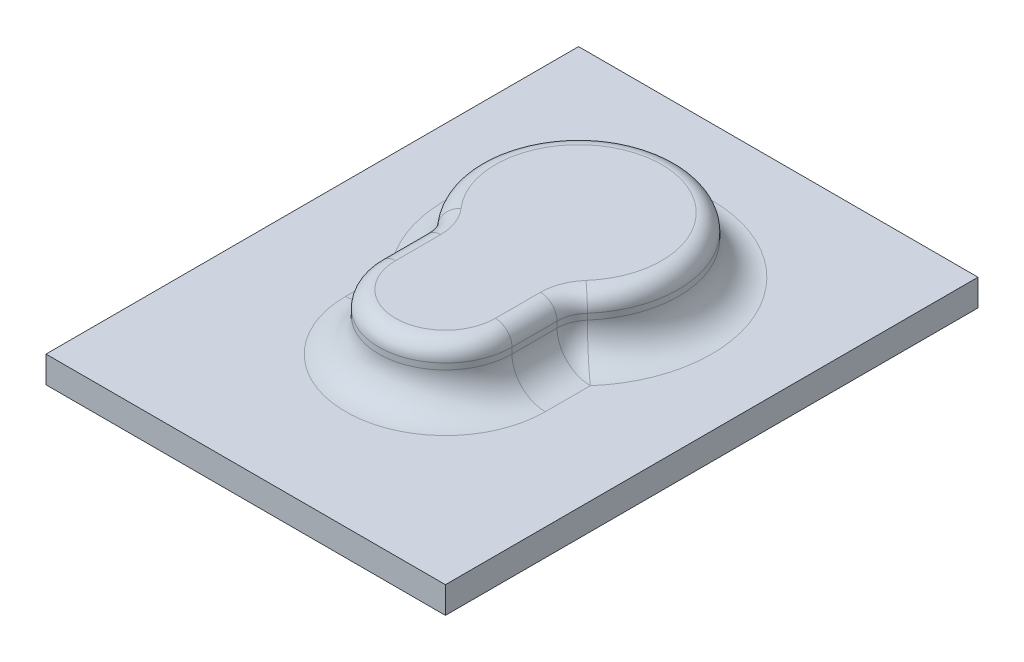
from build123d import *

# Parameters (mm, degrees)
SKETCH1_W           = 38.1
SKETCH1_H           = 50.8
BOSS_EXTRUDE1_DEPTH = 2.54
BOSS_EXTRUDE2_DEPTH = 5.334
FILLET1_R           = 3.175
FILLET2_R           = 1.5875


with BuildPart() as part:
    # Sketch1 → Boss-Extrude1 (new body)
    with BuildSketch(Plane(origin=(0, 0, 0), x_dir=(1, 0, 0), z_dir=(0, 1, 0))):
        with Locations((0, -6.35)):
            Rectangle(SKETCH1_W, SKETCH1_H)
    extrude(amount=BOSS_EXTRUDE1_DEPTH)

    # Sketch2 → Boss-Extrude2 (add)
    with BuildSketch(Plane(origin=(0, 2.54, 0), x_dir=(1, 0, 0), z_dir=(0, 1, 0))):
        with BuildLine():
            Line((6.35, -8.400260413), (6.35, -12.7))
            ThreePointArc((6.35, -12.7), (0, -19.05), (-6.35, -12.7))
            Line((-6.35, -12.7), (-6.35, -8.400260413))
            ThreePointArc((-6.35, -8.400260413), (-6.555059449, -7.277728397), (-7.14375, -6.300195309))
            ThreePointArc((-7.14375, -6.300195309), (0, 9.525), (7.14375, -6.300195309))
            ThreePointArc((7.14375, -6.300195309), (6.555059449, -7.277728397), (6.35, -8.400260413))
        make_face()
    extrude(amount=BOSS_EXTRUDE2_DEPTH)

    # Fillet1
    fillet1_edges = [part.edges().sort_by_distance(p)[0] for p in [
        (6.555059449, 2.54, 7.277728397),
        (0, 2.54, -9.525),
        (-6.555059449, 2.54, 7.277728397),
        (-6.35, 2.54, 10.550130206),
        (0, 2.54, 19.05),
        (6.35, 2.54, 10.550130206),
    ]]
    fillet(fillet1_edges, radius=FILLET1_R)

    # Fillet2
    fillet2_edges = [part.edges().sort_by_distance(p)[0] for p in [
        (6.555059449, 7.874, 7.277728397),
        (0, 7.874, -9.525),
        (-6.555059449, 7.874, 7.277728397),
        (-6.35, 7.874, 10.550130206),
        (0, 7.874, 19.05),
        (6.35, 7.874, 10.550130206),
    ]]
    fillet(fillet2_edges, radius=FILLET2_R)


solid = part.part
